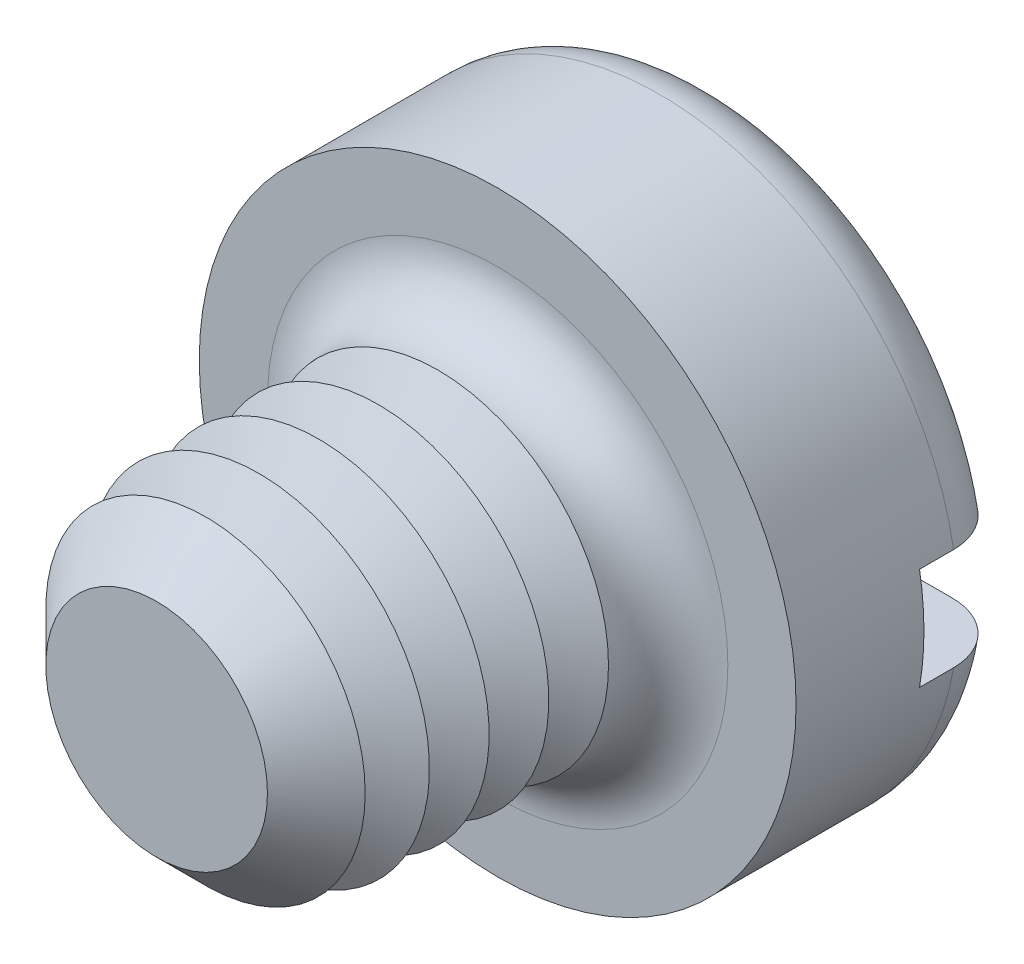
from build123d import *

# Parameters (mm, degrees)
SKETCH3_R           = 3.5
BOSS_EXTRUDE2_DEPTH = 2.6
SKETCH4_R           = 2
BOSS_EXTRUDE3_DEPTH = 4
FILLET1_R           = 0.7
CHAMFER1_SIZE       = 0.7
LPATTERN1_COUNT     = 4
LPATTERN1_PITCH     = 0.7
SKETCH8_W           = 7
SKETCH8_H           = 1.2
CUT_EXTRUDE1_DEPTH  = 1.1


with BuildPart() as part:
    # Sketch3 → Boss-Extrude2 (new body)
    with BuildSketch(Plane.XY):
        Circle(SKETCH3_R)
    extrude(amount=-BOSS_EXTRUDE2_DEPTH)

    # Sketch4 → Boss-Extrude3 (add)
    with BuildSketch(Plane.XY):
        Circle(SKETCH4_R)
    extrude(amount=BOSS_EXTRUDE3_DEPTH)

    # Fillet1
    fillet1_edges = [part.edges().sort_by_distance(p)[0] for p in [
        (-3.5, 0, -2.6),
        (-2, 0, 0),
    ]]
    fillet(fillet1_edges, radius=FILLET1_R)

    # Chamfer1
    chamfer1_edges = [part.edges().sort_by_distance(p)[0] for p in [
        (-2, 0, 4),
    ]]
    chamfer(chamfer1_edges, length=CHAMFER1_SIZE)

    # Sketch6 → Cut-Revolve1 (revolve, cut)
    with BuildSketch(Plane(origin=(0, 0, 0), x_dir=(0, 0, -1), z_dir=(1, 0, 0)), mode=Mode.PRIVATE) as cut_revolve1_sk:
        Polygon((-0.7, 2), (-1.05, 1.393782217), (-1.4, 2), align=None)
    cut_revolve1 = revolve(cut_revolve1_sk.sketch.rotate(Axis((0, 0, -1.694361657), (0, 0, 1)), 90), axis=Axis((0, 0, -1.694361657), (0, 0, 1)), mode=Mode.SUBTRACT)

    # LPattern1: Cut-Revolve1 ×4
    with Locations(*[(0, 0, i * LPATTERN1_PITCH) for i in range(1, LPATTERN1_COUNT)]):
        add(cut_revolve1, mode=Mode.SUBTRACT)

    # Sketch8 → Cut-Extrude1 (cut)
    with BuildSketch(Plane(origin=(0, 0, -2.6), x_dir=(-1, 0, 0), z_dir=(0, 0, -1))):
        Rectangle(SKETCH8_W, SKETCH8_H)
    extrude(amount=-CUT_EXTRUDE1_DEPTH, mode=Mode.SUBTRACT)


solid = part.part
